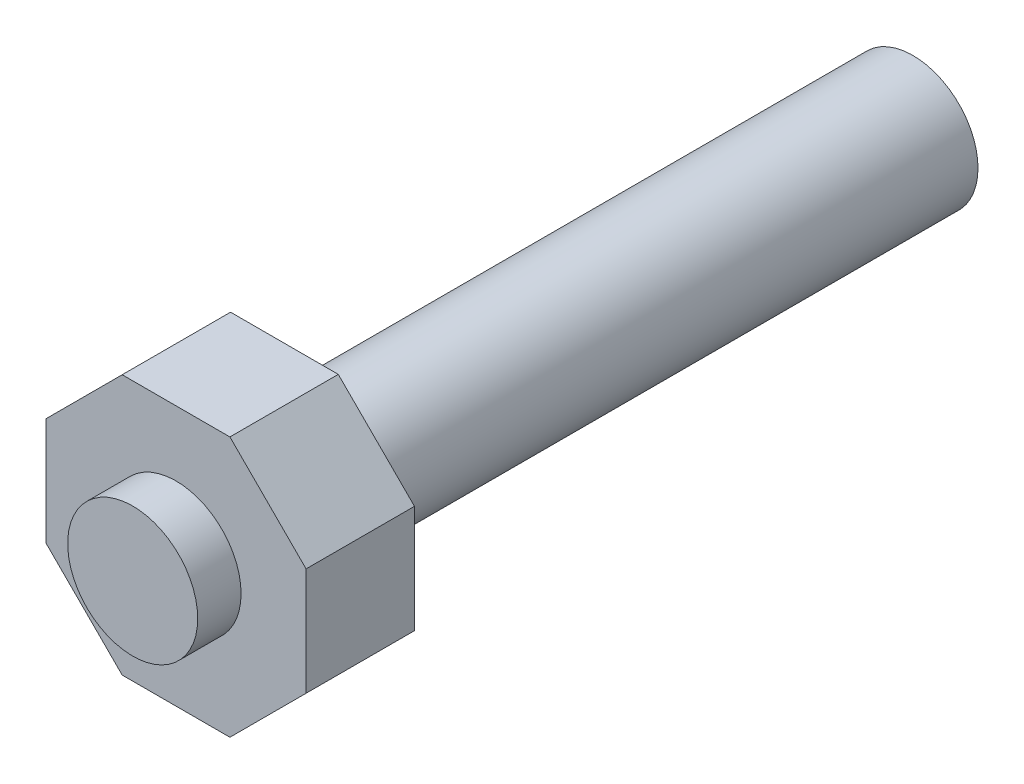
ISO-10303-21;
HEADER;
FILE_DESCRIPTION(('STEP AP214'),'2;1');
FILE_NAME('part.step','',(''),(''),'','','');
FILE_SCHEMA(('AUTOMOTIVE_DESIGN { 1 0 10303 214 1 1 1 1 }'));
ENDSEC;
DATA;
#1=APPLICATION_CONTEXT('core data for automotive mechanical design processes');
#2=APPLICATION_PROTOCOL_DEFINITION('international standard','automotive_design',2000,#1);
#3=PRODUCT_CONTEXT('',#1,'mechanical');
#4=PRODUCT('Part','Part','',(#3));
#5=PRODUCT_RELATED_PRODUCT_CATEGORY('part','',(#4));
#6=PRODUCT_DEFINITION_FORMATION('','',#4);
#7=PRODUCT_DEFINITION_CONTEXT('part definition',#1,'design');
#8=PRODUCT_DEFINITION('design','',#6,#7);
#9=PRODUCT_DEFINITION_SHAPE('','',#8);
#10=(LENGTH_UNIT() NAMED_UNIT(*) SI_UNIT(.MILLI.,.METRE.));
#11=(NAMED_UNIT(*) PLANE_ANGLE_UNIT() SI_UNIT($,.RADIAN.));
#12=(NAMED_UNIT(*) SI_UNIT($,.STERADIAN.) SOLID_ANGLE_UNIT());
#13=UNCERTAINTY_MEASURE_WITH_UNIT(LENGTH_MEASURE(1.E-05),#10,'distance_accuracy_value','');
#14=(GEOMETRIC_REPRESENTATION_CONTEXT(3) GLOBAL_UNCERTAINTY_ASSIGNED_CONTEXT((#13)) GLOBAL_UNIT_ASSIGNED_CONTEXT((#10,
#11,#12)) REPRESENTATION_CONTEXT('',''));
#15=CARTESIAN_POINT('',(0.,0.,0.));
#16=DIRECTION('',(0.,0.,1.));
#17=DIRECTION('',(1.,0.,0.));
#18=AXIS2_PLACEMENT_3D('',#15,#16,#17);
#19=CARTESIAN_POINT('',(6.,0.,58.));
#20=DIRECTION('',(0.,0.,1.));
#21=DIRECTION('',(1.,0.,0.));
#22=AXIS2_PLACEMENT_3D('',#19,#20,#21);
#23=PLANE('',#22);
#24=CARTESIAN_POINT('',(0.,0.,58.));
#25=DIRECTION('',(0.,0.,1.));
#26=DIRECTION('',(1.,0.,0.));
#27=AXIS2_PLACEMENT_3D('',#24,#25,#26);
#28=CIRCLE('',#27,6.);
#29=CARTESIAN_POINT('',(6.,0.,58.));
#30=VERTEX_POINT('',#29);
#31=EDGE_CURVE('E22',#30,#30,#28,.T.);
#32=ORIENTED_EDGE('',*,*,#31,.T.);
#33=EDGE_LOOP('',(#32));
#34=FACE_BOUND('',#33,.T.);
#35=DIRECTION('',(-0.707106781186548,-0.707106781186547,0.));
#36=VECTOR('',#35,1.);
#37=CARTESIAN_POINT('',(12.,-4.97056274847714,58.));
#38=LINE('',#37,#36);
#39=CARTESIAN_POINT('',(12.,-4.97056274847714,58.));
#40=VERTEX_POINT('',#39);
#41=CARTESIAN_POINT('',(4.97056274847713,-12.,58.));
#42=VERTEX_POINT('',#41);
#43=EDGE_CURVE('E91',#40,#42,#38,.T.);
#44=ORIENTED_EDGE('',*,*,#43,.T.);
#45=DIRECTION('',(1.,0.,0.));
#46=VECTOR('',#45,1.);
#47=CARTESIAN_POINT('',(-4.97056274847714,-12.,58.));
#48=LINE('',#47,#46);
#49=CARTESIAN_POINT('',(-4.97056274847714,-12.,58.));
#50=VERTEX_POINT('',#49);
#51=EDGE_CURVE('E97',#50,#42,#48,.T.);
#52=ORIENTED_EDGE('',*,*,#51,.F.);
#53=DIRECTION('',(0.707106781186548,-0.707106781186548,0.));
#54=VECTOR('',#53,1.);
#55=CARTESIAN_POINT('',(-12.,-4.97056274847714,58.));
#56=LINE('',#55,#54);
#57=CARTESIAN_POINT('',(-12.,-4.97056274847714,58.));
#58=VERTEX_POINT('',#57);
#59=EDGE_CURVE('E29',#58,#50,#56,.T.);
#60=ORIENTED_EDGE('',*,*,#59,.F.);
#61=DIRECTION('',(0.,-1.,0.));
#62=VECTOR('',#61,1.);
#63=CARTESIAN_POINT('',(-12.,4.97056274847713,58.));
#64=LINE('',#63,#62);
#65=CARTESIAN_POINT('',(-12.,4.97056274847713,58.));
#66=VERTEX_POINT('',#65);
#67=EDGE_CURVE('E111',#66,#58,#64,.T.);
#68=ORIENTED_EDGE('',*,*,#67,.F.);
#69=DIRECTION('',(0.707106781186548,0.707106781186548,0.));
#70=VECTOR('',#69,1.);
#71=CARTESIAN_POINT('',(-12.,4.97056274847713,58.));
#72=LINE('',#71,#70);
#73=CARTESIAN_POINT('',(-4.97056274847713,12.,58.));
#74=VERTEX_POINT('',#73);
#75=EDGE_CURVE('E108',#66,#74,#72,.T.);
#76=ORIENTED_EDGE('',*,*,#75,.T.);
#77=DIRECTION('',(1.,0.,0.));
#78=VECTOR('',#77,1.);
#79=CARTESIAN_POINT('',(-4.97056274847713,12.,58.));
#80=LINE('',#79,#78);
#81=CARTESIAN_POINT('',(4.97056274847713,12.,58.));
#82=VERTEX_POINT('',#81);
#83=EDGE_CURVE('E103',#74,#82,#80,.T.);
#84=ORIENTED_EDGE('',*,*,#83,.T.);
#85=DIRECTION('',(0.707106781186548,-0.707106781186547,0.));
#86=VECTOR('',#85,1.);
#87=CARTESIAN_POINT('',(4.97056274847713,12.,58.));
#88=LINE('',#87,#86);
#89=CARTESIAN_POINT('',(12.,4.97056274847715,58.));
#90=VERTEX_POINT('',#89);
#91=EDGE_CURVE('E101',#82,#90,#88,.T.);
#92=ORIENTED_EDGE('',*,*,#91,.T.);
#93=DIRECTION('',(0.,-1.,0.));
#94=VECTOR('',#93,1.);
#95=CARTESIAN_POINT('',(12.,4.97056274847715,58.));
#96=LINE('',#95,#94);
#97=EDGE_CURVE('E83',#90,#40,#96,.T.);
#98=ORIENTED_EDGE('',*,*,#97,.T.);
#99=EDGE_LOOP('',(#44,#52,#60,#68,#76,#84,#92,#98));
#100=FACE_BOUND('',#99,.T.);
#101=ADVANCED_FACE('F14',(#34,#100),#23,.F.);
#102=CARTESIAN_POINT('',(0.,0.,0.));
#103=DIRECTION('',(0.,0.,1.));
#104=DIRECTION('',(1.,0.,0.));
#105=AXIS2_PLACEMENT_3D('',#102,#103,#104);
#106=PLANE('',#105);
#107=CARTESIAN_POINT('',(0.,0.,0.));
#108=DIRECTION('',(0.,0.,1.));
#109=DIRECTION('',(1.,0.,0.));
#110=AXIS2_PLACEMENT_3D('',#107,#108,#109);
#111=CIRCLE('',#110,6.);
#112=CARTESIAN_POINT('',(6.,0.,0.));
#113=VERTEX_POINT('',#112);
#114=EDGE_CURVE('E9',#113,#113,#111,.T.);
#115=ORIENTED_EDGE('',*,*,#114,.F.);
#116=EDGE_LOOP('',(#115));
#117=FACE_BOUND('',#116,.T.);
#118=ADVANCED_FACE('F16',(#117),#106,.F.);
#119=CARTESIAN_POINT('',(0.,0.,80.));
#120=DIRECTION('',(0.,0.,1.));
#121=DIRECTION('',(1.,0.,0.));
#122=AXIS2_PLACEMENT_3D('',#119,#120,#121);
#123=CYLINDRICAL_SURFACE('',#122,6.);
#124=ORIENTED_EDGE('',*,*,#31,.F.);
#125=EDGE_LOOP('',(#124));
#126=FACE_BOUND('',#125,.T.);
#127=ORIENTED_EDGE('',*,*,#114,.T.);
#128=EDGE_LOOP('',(#127));
#129=FACE_BOUND('',#128,.T.);
#130=ADVANCED_FACE('F155',(#126,#129),#123,.T.);
#131=CARTESIAN_POINT('',(12.,-4.97056274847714,68.));
#132=DIRECTION('',(0.707106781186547,-0.707106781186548,0.));
#133=DIRECTION('',(0.707106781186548,0.707106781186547,0.));
#134=AXIS2_PLACEMENT_3D('',#131,#132,#133);
#135=PLANE('',#134);
#136=DIRECTION('',(0.,0.,-1.));
#137=VECTOR('',#136,1.);
#138=CARTESIAN_POINT('',(12.,-4.97056274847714,68.));
#139=LINE('',#138,#137);
#140=CARTESIAN_POINT('',(12.,-4.97056274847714,68.));
#141=VERTEX_POINT('',#140);
#142=EDGE_CURVE('E79',#141,#40,#139,.T.);
#143=ORIENTED_EDGE('',*,*,#142,.F.);
#144=DIRECTION('',(-0.707106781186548,-0.707106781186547,0.));
#145=VECTOR('',#144,1.);
#146=CARTESIAN_POINT('',(12.,-4.97056274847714,68.));
#147=LINE('',#146,#145);
#148=CARTESIAN_POINT('',(4.97056274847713,-12.,68.));
#149=VERTEX_POINT('',#148);
#150=EDGE_CURVE('E37',#141,#149,#147,.T.);
#151=ORIENTED_EDGE('',*,*,#150,.T.);
#152=DIRECTION('',(0.,0.,-1.));
#153=VECTOR('',#152,1.);
#154=CARTESIAN_POINT('',(4.97056274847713,-12.,68.));
#155=LINE('',#154,#153);
#156=EDGE_CURVE('E93',#149,#42,#155,.T.);
#157=ORIENTED_EDGE('',*,*,#156,.T.);
#158=ORIENTED_EDGE('',*,*,#43,.F.);
#159=EDGE_LOOP('',(#143,#151,#157,#158));
#160=FACE_BOUND('',#159,.T.);
#161=ADVANCED_FACE('F92',(#160),#135,.T.);
#162=CARTESIAN_POINT('',(12.,4.97056274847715,68.));
#163=DIRECTION('',(1.,0.,0.));
#164=DIRECTION('',(0.,0.,-1.));
#165=AXIS2_PLACEMENT_3D('',#162,#163,#164);
#166=PLANE('',#165);
#167=DIRECTION('',(0.,0.,-1.));
#168=VECTOR('',#167,1.);
#169=CARTESIAN_POINT('',(12.,4.97056274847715,68.));
#170=LINE('',#169,#168);
#171=CARTESIAN_POINT('',(12.,4.97056274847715,68.));
#172=VERTEX_POINT('',#171);
#173=EDGE_CURVE('E88',#172,#90,#170,.T.);
#174=ORIENTED_EDGE('',*,*,#173,.F.);
#175=DIRECTION('',(0.,-1.,0.));
#176=VECTOR('',#175,1.);
#177=CARTESIAN_POINT('',(12.,4.97056274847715,68.));
#178=LINE('',#177,#176);
#179=EDGE_CURVE('E86',#172,#141,#178,.T.);
#180=ORIENTED_EDGE('',*,*,#179,.T.);
#181=ORIENTED_EDGE('',*,*,#142,.T.);
#182=ORIENTED_EDGE('',*,*,#97,.F.);
#183=EDGE_LOOP('',(#174,#180,#181,#182));
#184=FACE_BOUND('',#183,.T.);
#185=ADVANCED_FACE('F81',(#184),#166,.T.);
#186=CARTESIAN_POINT('',(4.97056274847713,12.,68.));
#187=DIRECTION('',(0.707106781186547,0.707106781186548,0.));
#188=DIRECTION('',(-0.707106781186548,0.707106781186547,0.));
#189=AXIS2_PLACEMENT_3D('',#186,#187,#188);
#190=PLANE('',#189);
#191=DIRECTION('',(0.,0.,-1.));
#192=VECTOR('',#191,1.);
#193=CARTESIAN_POINT('',(4.97056274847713,12.,68.));
#194=LINE('',#193,#192);
#195=CARTESIAN_POINT('',(4.97056274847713,12.,68.));
#196=VERTEX_POINT('',#195);
#197=EDGE_CURVE('E144',#196,#82,#194,.T.);
#198=ORIENTED_EDGE('',*,*,#197,.F.);
#199=DIRECTION('',(0.707106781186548,-0.707106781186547,0.));
#200=VECTOR('',#199,1.);
#201=CARTESIAN_POINT('',(4.97056274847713,12.,68.));
#202=LINE('',#201,#200);
#203=EDGE_CURVE('E124',#196,#172,#202,.T.);
#204=ORIENTED_EDGE('',*,*,#203,.T.);
#205=ORIENTED_EDGE('',*,*,#173,.T.);
#206=ORIENTED_EDGE('',*,*,#91,.F.);
#207=EDGE_LOOP('',(#198,#204,#205,#206));
#208=FACE_BOUND('',#207,.T.);
#209=ADVANCED_FACE('F186',(#208),#190,.T.);
#210=CARTESIAN_POINT('',(-4.97056274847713,12.,68.));
#211=DIRECTION('',(0.,1.,0.));
#212=DIRECTION('',(0.,0.,1.));
#213=AXIS2_PLACEMENT_3D('',#210,#211,#212);
#214=PLANE('',#213);
#215=DIRECTION('',(0.,0.,-1.));
#216=VECTOR('',#215,1.);
#217=CARTESIAN_POINT('',(-4.97056274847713,12.,68.));
#218=LINE('',#217,#216);
#219=CARTESIAN_POINT('',(-4.97056274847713,12.,68.));
#220=VERTEX_POINT('',#219);
#221=EDGE_CURVE('E142',#220,#74,#218,.T.);
#222=ORIENTED_EDGE('',*,*,#221,.F.);
#223=DIRECTION('',(1.,0.,0.));
#224=VECTOR('',#223,1.);
#225=CARTESIAN_POINT('',(-4.97056274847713,12.,68.));
#226=LINE('',#225,#224);
#227=EDGE_CURVE('E128',#220,#196,#226,.T.);
#228=ORIENTED_EDGE('',*,*,#227,.T.);
#229=ORIENTED_EDGE('',*,*,#197,.T.);
#230=ORIENTED_EDGE('',*,*,#83,.F.);
#231=EDGE_LOOP('',(#222,#228,#229,#230));
#232=FACE_BOUND('',#231,.T.);
#233=ADVANCED_FACE('F189',(#232),#214,.T.);
#234=CARTESIAN_POINT('',(-12.,4.97056274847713,68.));
#235=DIRECTION('',(-0.707106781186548,0.707106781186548,0.));
#236=DIRECTION('',(-0.707106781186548,-0.707106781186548,0.));
#237=AXIS2_PLACEMENT_3D('',#234,#235,#236);
#238=PLANE('',#237);
#239=DIRECTION('',(0.,0.,-1.));
#240=VECTOR('',#239,1.);
#241=CARTESIAN_POINT('',(-12.,4.97056274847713,68.));
#242=LINE('',#241,#240);
#243=CARTESIAN_POINT('',(-12.,4.97056274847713,68.));
#244=VERTEX_POINT('',#243);
#245=EDGE_CURVE('E140',#244,#66,#242,.T.);
#246=ORIENTED_EDGE('',*,*,#245,.F.);
#247=DIRECTION('',(0.707106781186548,0.707106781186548,0.));
#248=VECTOR('',#247,1.);
#249=CARTESIAN_POINT('',(-12.,4.97056274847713,68.));
#250=LINE('',#249,#248);
#251=EDGE_CURVE('E125',#244,#220,#250,.T.);
#252=ORIENTED_EDGE('',*,*,#251,.T.);
#253=ORIENTED_EDGE('',*,*,#221,.T.);
#254=ORIENTED_EDGE('',*,*,#75,.F.);
#255=EDGE_LOOP('',(#246,#252,#253,#254));
#256=FACE_BOUND('',#255,.T.);
#257=ADVANCED_FACE('F193',(#256),#238,.T.);
#258=CARTESIAN_POINT('',(-12.,4.97056274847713,68.));
#259=DIRECTION('',(1.,0.,0.));
#260=DIRECTION('',(0.,1.,0.));
#261=AXIS2_PLACEMENT_3D('',#258,#259,#260);
#262=PLANE('',#261);
#263=DIRECTION('',(0.,0.,-1.));
#264=VECTOR('',#263,1.);
#265=CARTESIAN_POINT('',(-12.,-4.97056274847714,68.));
#266=LINE('',#265,#264);
#267=CARTESIAN_POINT('',(-12.,-4.97056274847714,68.));
#268=VERTEX_POINT('',#267);
#269=EDGE_CURVE('E138',#268,#58,#266,.T.);
#270=ORIENTED_EDGE('',*,*,#269,.F.);
#271=DIRECTION('',(0.,-1.,0.));
#272=VECTOR('',#271,1.);
#273=CARTESIAN_POINT('',(-12.,4.97056274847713,68.));
#274=LINE('',#273,#272);
#275=EDGE_CURVE('E122',#244,#268,#274,.T.);
#276=ORIENTED_EDGE('',*,*,#275,.F.);
#277=ORIENTED_EDGE('',*,*,#245,.T.);
#278=ORIENTED_EDGE('',*,*,#67,.T.);
#279=EDGE_LOOP('',(#270,#276,#277,#278));
#280=FACE_BOUND('',#279,.T.);
#281=ADVANCED_FACE('F197',(#280),#262,.F.);
#282=CARTESIAN_POINT('',(-12.,-4.97056274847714,68.));
#283=DIRECTION('',(0.707106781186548,0.707106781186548,0.));
#284=DIRECTION('',(-0.707106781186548,0.707106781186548,0.));
#285=AXIS2_PLACEMENT_3D('',#282,#283,#284);
#286=PLANE('',#285);
#287=DIRECTION('',(0.,0.,-1.));
#288=VECTOR('',#287,1.);
#289=CARTESIAN_POINT('',(-4.97056274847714,-12.,68.));
#290=LINE('',#289,#288);
#291=CARTESIAN_POINT('',(-4.97056274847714,-12.,68.));
#292=VERTEX_POINT('',#291);
#293=EDGE_CURVE('E136',#292,#50,#290,.T.);
#294=ORIENTED_EDGE('',*,*,#293,.F.);
#295=DIRECTION('',(0.707106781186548,-0.707106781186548,0.));
#296=VECTOR('',#295,1.);
#297=CARTESIAN_POINT('',(-12.,-4.97056274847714,68.));
#298=LINE('',#297,#296);
#299=EDGE_CURVE('E119',#268,#292,#298,.T.);
#300=ORIENTED_EDGE('',*,*,#299,.F.);
#301=ORIENTED_EDGE('',*,*,#269,.T.);
#302=ORIENTED_EDGE('',*,*,#59,.T.);
#303=EDGE_LOOP('',(#294,#300,#301,#302));
#304=FACE_BOUND('',#303,.T.);
#305=ADVANCED_FACE('F201',(#304),#286,.F.);
#306=CARTESIAN_POINT('',(-4.97056274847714,-12.,68.));
#307=DIRECTION('',(0.,1.,0.));
#308=DIRECTION('',(0.,0.,1.));
#309=AXIS2_PLACEMENT_3D('',#306,#307,#308);
#310=PLANE('',#309);
#311=DIRECTION('',(1.,0.,0.));
#312=VECTOR('',#311,1.);
#313=CARTESIAN_POINT('',(-4.97056274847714,-12.,68.));
#314=LINE('',#313,#312);
#315=EDGE_CURVE('E116',#292,#149,#314,.T.);
#316=ORIENTED_EDGE('',*,*,#315,.F.);
#317=ORIENTED_EDGE('',*,*,#293,.T.);
#318=ORIENTED_EDGE('',*,*,#51,.T.);
#319=ORIENTED_EDGE('',*,*,#156,.F.);
#320=EDGE_LOOP('',(#316,#317,#318,#319));
#321=FACE_BOUND('',#320,.T.);
#322=ADVANCED_FACE('F182',(#321),#310,.F.);
#323=CARTESIAN_POINT('',(6.,0.,72.));
#324=DIRECTION('',(0.,0.,-1.));
#325=DIRECTION('',(-1.,0.,0.));
#326=AXIS2_PLACEMENT_3D('',#323,#324,#325);
#327=PLANE('',#326);
#328=CARTESIAN_POINT('',(0.,0.,72.));
#329=DIRECTION('',(0.,0.,1.));
#330=DIRECTION('',(1.,0.,0.));
#331=AXIS2_PLACEMENT_3D('',#328,#329,#330);
#332=CIRCLE('',#331,6.);
#333=CARTESIAN_POINT('',(6.,0.,72.));
#334=VERTEX_POINT('',#333);
#335=EDGE_CURVE('E87',#334,#334,#332,.T.);
#336=ORIENTED_EDGE('',*,*,#335,.T.);
#337=EDGE_LOOP('',(#336));
#338=FACE_BOUND('',#337,.T.);
#339=ADVANCED_FACE('F178',(#338),#327,.F.);
#340=CARTESIAN_POINT('',(0.,0.,80.));
#341=DIRECTION('',(0.,0.,1.));
#342=DIRECTION('',(1.,0.,0.));
#343=AXIS2_PLACEMENT_3D('',#340,#341,#342);
#344=CYLINDRICAL_SURFACE('',#343,6.);
#345=ORIENTED_EDGE('',*,*,#335,.F.);
#346=EDGE_LOOP('',(#345));
#347=FACE_BOUND('',#346,.T.);
#348=CARTESIAN_POINT('',(0.,0.,68.));
#349=DIRECTION('',(0.,0.,1.));
#350=DIRECTION('',(1.,0.,0.));
#351=AXIS2_PLACEMENT_3D('',#348,#349,#350);
#352=CIRCLE('',#351,6.);
#353=CARTESIAN_POINT('',(6.,0.,68.));
#354=VERTEX_POINT('',#353);
#355=EDGE_CURVE('E149',#354,#354,#352,.T.);
#356=ORIENTED_EDGE('',*,*,#355,.T.);
#357=EDGE_LOOP('',(#356));
#358=FACE_BOUND('',#357,.T.);
#359=ADVANCED_FACE('F174',(#347,#358),#344,.T.);
#360=CARTESIAN_POINT('',(14.,0.,68.));
#361=DIRECTION('',(0.,0.,-1.));
#362=DIRECTION('',(-1.,0.,0.));
#363=AXIS2_PLACEMENT_3D('',#360,#361,#362);
#364=PLANE('',#363);
#365=ORIENTED_EDGE('',*,*,#355,.F.);
#366=EDGE_LOOP('',(#365));
#367=FACE_BOUND('',#366,.T.);
#368=ORIENTED_EDGE('',*,*,#150,.F.);
#369=ORIENTED_EDGE('',*,*,#179,.F.);
#370=ORIENTED_EDGE('',*,*,#203,.F.);
#371=ORIENTED_EDGE('',*,*,#227,.F.);
#372=ORIENTED_EDGE('',*,*,#251,.F.);
#373=ORIENTED_EDGE('',*,*,#275,.T.);
#374=ORIENTED_EDGE('',*,*,#299,.T.);
#375=ORIENTED_EDGE('',*,*,#315,.T.);
#376=EDGE_LOOP('',(#368,#369,#370,#371,#372,#373,#374,#375));
#377=FACE_BOUND('',#376,.T.);
#378=ADVANCED_FACE('F171',(#367,#377),#364,.F.);
#379=CLOSED_SHELL('',(#101,#118,#130,#161,#185,#209,#233,#257,#281,#305,#322,#339,#359,#378));
#380=MANIFOLD_SOLID_BREP('B1',#379);
#381=ADVANCED_BREP_SHAPE_REPRESENTATION('',(#18,#380),#14);
#382=SHAPE_DEFINITION_REPRESENTATION(#9,#381);
ENDSEC;
END-ISO-10303-21;
